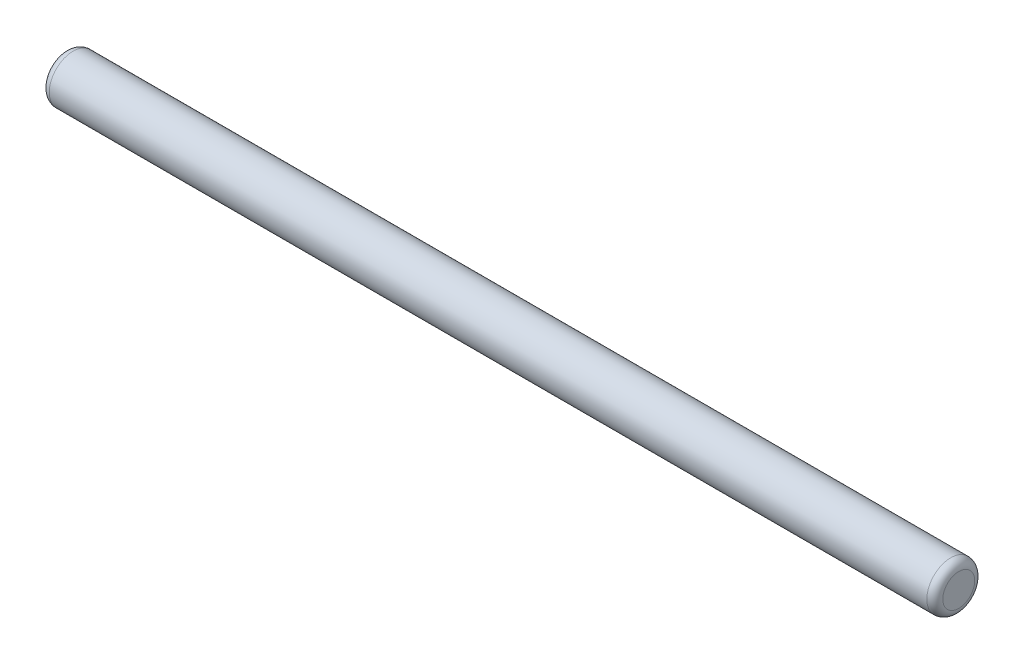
from build123d import *

# Parameters (mm, degrees)
SKETCH1_R           = 4.7625
BOSS_EXTRUDE1_DEPTH = 177.8
FILLET1_R           = 1.5875


with BuildPart() as part:
    # Sketch1 → Boss-Extrude1 (new body)
    with BuildSketch(Plane(origin=(0, 0, 0), x_dir=(0, 0, -1), z_dir=(1, 0, 0))):
        Circle(SKETCH1_R)
    extrude(amount=BOSS_EXTRUDE1_DEPTH)

    # Fillet1
    fillet1_edges = [part.edges().sort_by_distance(p)[0] for p in [
        (0, 0, 4.7625),
        (177.8, 0, 4.7625),
    ]]
    fillet(fillet1_edges, radius=FILLET1_R)


solid = part.part
